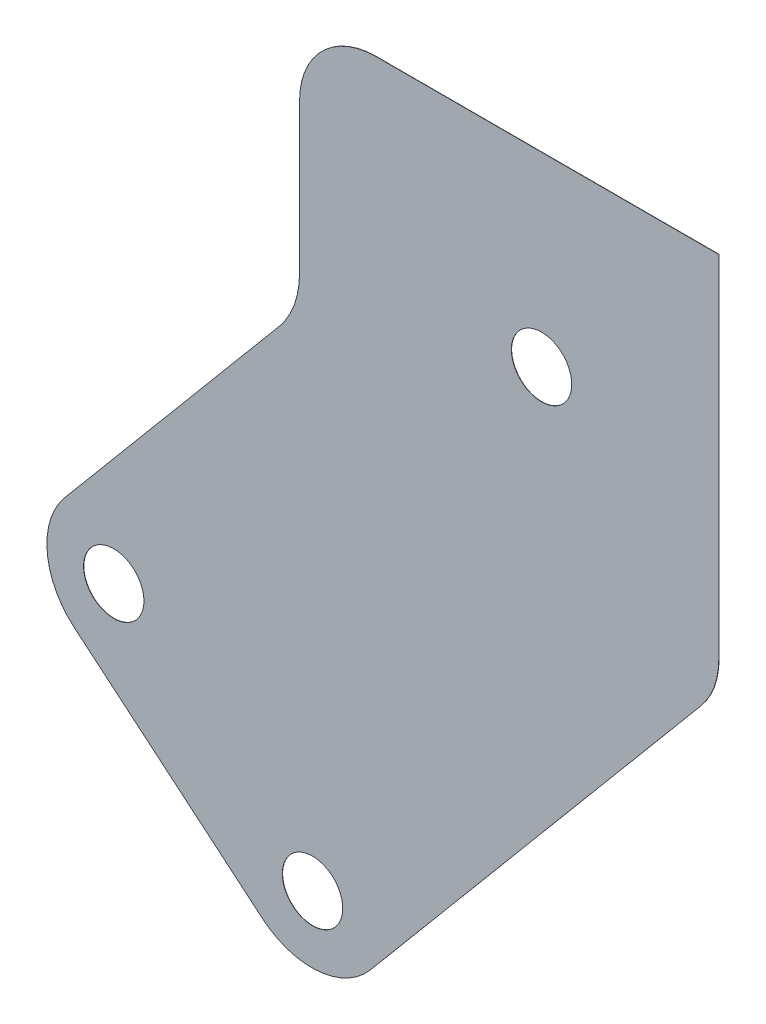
from build123d import *

# Parameters (mm, degrees)
BOSS_EXTRUDE1_DEPTH = 0.0254
HOLE1_D             = 5.6134


with BuildPart() as part:
    # Sketch1 → Boss-Extrude1 (new body)
    with BuildSketch(Plane.XY):
        with BuildLine():
            Line((-545.839152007, -13.707872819), (-577.716152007, -13.707872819))
            ThreePointArc((-577.716152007, -13.707872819), (-582.745095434, -15.790929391), (-584.828152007, -20.819872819))
            Line((-584.828152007, -20.819872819), (-584.828152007, -34.722664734))
            ThreePointArc((-584.828152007, -34.722664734), (-585.318330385, -37.502604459), (-586.729742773, -39.947242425))
            Line((-586.729742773, -39.947242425), (-606.659260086, -63.698316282))
            ThreePointArc((-606.659260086, -63.698316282), (-608.296088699, -68.889673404), (-605.782657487, -73.717929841))
            Line((-605.782657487, -73.717929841), (-588.270881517, -88.412054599))
            ThreePointArc((-588.270881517, -88.412054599), (-583.079524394, -90.048883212), (-578.251267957, -87.535452))
            Line((-578.251267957, -87.535452), (-547.503043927, -50.891145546))
            ThreePointArc((-547.503043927, -50.891145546), (-546.268058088, -48.752087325), (-545.839152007, -46.319640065))
            Line((-545.839152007, -46.319640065), (-545.839152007, -13.707872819))
        make_face()
    extrude(amount=BOSS_EXTRUDE1_DEPTH)

    # Hole1 (through all)
    with Locations(Plane(origin=(-605.768184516, -57.756677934, 0.0254), x_dir=(1, 0, 0), z_dir=(0, 0, 1))):
        with Locations((3.662424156, -10.591411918), (22.147076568, -26.101876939), (43.444388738, 26.748085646)):
            Hole(HOLE1_D / 2)


solid = part.part
